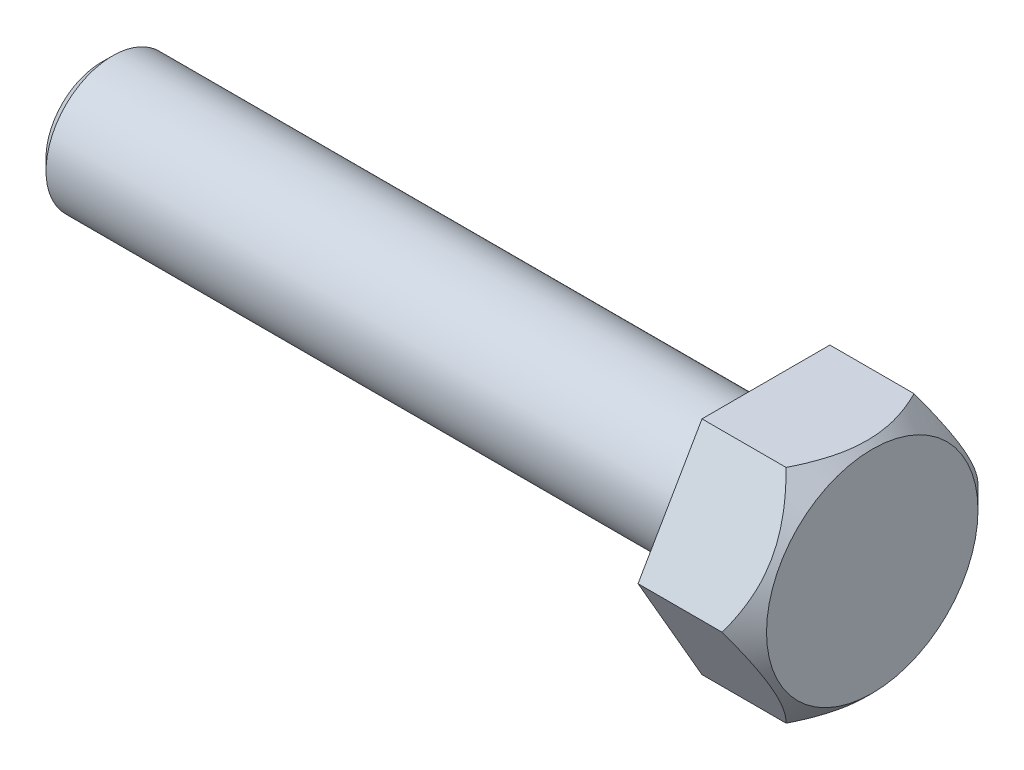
ISO-10303-21;
HEADER;
FILE_DESCRIPTION(('STEP AP214'),'2;1');
FILE_NAME('part.step','',(''),(''),'','','');
FILE_SCHEMA(('AUTOMOTIVE_DESIGN { 1 0 10303 214 1 1 1 1 }'));
ENDSEC;
DATA;
#1=APPLICATION_CONTEXT('core data for automotive mechanical design processes');
#2=APPLICATION_PROTOCOL_DEFINITION('international standard','automotive_design',2000,#1);
#3=PRODUCT_CONTEXT('',#1,'mechanical');
#4=PRODUCT('Part','Part','',(#3));
#5=PRODUCT_RELATED_PRODUCT_CATEGORY('part','',(#4));
#6=PRODUCT_DEFINITION_FORMATION('','',#4);
#7=PRODUCT_DEFINITION_CONTEXT('part definition',#1,'design');
#8=PRODUCT_DEFINITION('design','',#6,#7);
#9=PRODUCT_DEFINITION_SHAPE('','',#8);
#10=(LENGTH_UNIT() NAMED_UNIT(*) SI_UNIT(.MILLI.,.METRE.));
#11=(NAMED_UNIT(*) PLANE_ANGLE_UNIT() SI_UNIT($,.RADIAN.));
#12=(NAMED_UNIT(*) SI_UNIT($,.STERADIAN.) SOLID_ANGLE_UNIT());
#13=UNCERTAINTY_MEASURE_WITH_UNIT(LENGTH_MEASURE(1.E-05),#10,'distance_accuracy_value','');
#14=(GEOMETRIC_REPRESENTATION_CONTEXT(3) GLOBAL_UNCERTAINTY_ASSIGNED_CONTEXT((#13)) GLOBAL_UNIT_ASSIGNED_CONTEXT((#10,
#11,#12)) REPRESENTATION_CONTEXT('',''));
#15=CARTESIAN_POINT('',(0.,0.,0.));
#16=DIRECTION('',(0.,0.,1.));
#17=DIRECTION('',(1.,0.,0.));
#18=AXIS2_PLACEMENT_3D('',#15,#16,#17);
#19=CARTESIAN_POINT('',(4.80000000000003,5.,2.88675134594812));
#20=DIRECTION('',(0.,-0.500000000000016,-0.866025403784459));
#21=DIRECTION('',(0.,0.866025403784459,-0.500000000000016));
#22=AXIS2_PLACEMENT_3D('',#19,#20,#21);
#23=PLANE('',#22);
#24=CARTESIAN_POINT('',(3.79988452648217,5.00020000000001,2.88663587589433));
#25=CARTESIAN_POINT('',(3.84951645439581,4.91422723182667,2.93627227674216));
#26=CARTESIAN_POINT('',(3.89762527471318,4.82759363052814,2.98629020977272));
#27=CARTESIAN_POINT('',(3.99033336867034,4.65287511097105,3.08716399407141));
#28=CARTESIAN_POINT('',(4.03493072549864,4.56478943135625,3.13802028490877));
#29=CARTESIAN_POINT('',(4.1631409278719,4.29734143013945,3.29243146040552));
#30=CARTESIAN_POINT('',(4.24062493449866,4.1157150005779,3.39729352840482));
#31=CARTESIAN_POINT('',(4.37331105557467,3.7494507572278,3.60875628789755));
#32=CARTESIAN_POINT('',(4.42884745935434,3.56490656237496,3.71530292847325));
#33=CARTESIAN_POINT('',(4.49308950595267,3.28505622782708,3.87687459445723));
#34=CARTESIAN_POINT('',(4.51131783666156,3.19136076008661,3.93096969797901));
#35=CARTESIAN_POINT('',(4.54100781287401,3.00317647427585,4.03961794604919));
#36=CARTESIAN_POINT('',(4.55247046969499,2.90868777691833,4.09417102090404));
#37=CARTESIAN_POINT('',(4.57168913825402,2.67843374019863,4.22710825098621));
#38=CARTESIAN_POINT('',(4.57572171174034,2.54242031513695,4.30563563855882));
#39=CARTESIAN_POINT('',(4.56895414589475,2.27063858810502,4.46254889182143));
#40=CARTESIAN_POINT('',(4.55814880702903,2.13487038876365,4.54093469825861));
#41=CARTESIAN_POINT('',(4.52234235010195,1.86461396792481,4.69696731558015));
#42=CARTESIAN_POINT('',(4.49732535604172,1.73012734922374,4.77461320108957));
#43=CARTESIAN_POINT('',(4.43445567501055,1.46346560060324,4.92857043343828));
#44=CARTESIAN_POINT('',(4.39660397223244,1.33129029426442,5.00488188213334));
#45=CARTESIAN_POINT('',(4.31873011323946,1.09665179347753,5.14035048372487));
#46=CARTESIAN_POINT('',(4.28075574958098,0.993669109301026,5.19980756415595));
#47=CARTESIAN_POINT('',(4.19868737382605,0.789552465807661,5.31765436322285));
#48=CARTESIAN_POINT('',(4.15459317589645,0.688418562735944,5.37604404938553));
#49=CARTESIAN_POINT('',(4.06127361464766,0.488318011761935,5.49157215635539));
#50=CARTESIAN_POINT('',(4.01206438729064,0.389345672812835,5.54871386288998));
#51=CARTESIAN_POINT('',(3.90916087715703,0.193233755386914,5.66193913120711));
#52=CARTESIAN_POINT('',(3.85546934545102,0.0960930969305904,5.71802331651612));
#53=CARTESIAN_POINT('',(3.79988452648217,-0.000200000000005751,5.7736181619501));
#54=B_SPLINE_CURVE_WITH_KNOTS('',3,(#24,#25,#26,#27,#28,#29,#30,#31,#32,#33,#34,#35,#36,#37,#38,
#39,#40,#41,#42,#43,#44,#45,#46,#47,#48,#49,#50,#51,#52,#53),.UNSPECIFIED.,.F.,.F.,(4,2,2,2,2,2,
2,2,2,2,2,2,2,2,4),(0.,0.332945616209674,0.666071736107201,1.33592065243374,1.99513262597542,
2.32409207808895,2.65300234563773,3.12358963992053,3.5943418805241,4.06562104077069,
4.53686407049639,4.91117956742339,5.28550643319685,5.65868635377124,6.03163889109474),.UNSPECIFIED.);
#55=CARTESIAN_POINT('',(3.80000000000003,5.,2.88675134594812));
#56=VERTEX_POINT('',#55);
#57=CARTESIAN_POINT('',(3.80000000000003,-2.22044604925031E-13,5.77350269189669));
#58=VERTEX_POINT('',#57);
#59=EDGE_CURVE('E88',#56,#58,#54,.T.);
#60=ORIENTED_EDGE('',*,*,#59,.F.);
#61=DIRECTION('',(-1.,0.,0.));
#62=VECTOR('',#61,1.);
#63=CARTESIAN_POINT('',(4.80000000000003,5.,2.88675134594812));
#64=LINE('',#63,#62);
#65=CARTESIAN_POINT('',(0.,5.,2.88675134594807));
#66=VERTEX_POINT('',#65);
#67=EDGE_CURVE('E59',#56,#66,#64,.T.);
#68=ORIENTED_EDGE('',*,*,#67,.T.);
#69=DIRECTION('',(0.,-0.866025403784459,0.500000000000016));
#70=VECTOR('',#69,1.);
#71=CARTESIAN_POINT('',(0.,5.,2.88675134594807));
#72=LINE('',#71,#70);
#73=CARTESIAN_POINT('',(0.,-3.33066907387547E-13,5.77350269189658));
#74=VERTEX_POINT('',#73);
#75=EDGE_CURVE('E95',#66,#74,#72,.T.);
#76=ORIENTED_EDGE('',*,*,#75,.T.);
#77=DIRECTION('',(-1.,0.,0.));
#78=VECTOR('',#77,1.);
#79=CARTESIAN_POINT('',(4.80000000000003,-2.22044604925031E-13,5.77350269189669));
#80=LINE('',#79,#78);
#81=EDGE_CURVE('E101',#58,#74,#80,.T.);
#82=ORIENTED_EDGE('',*,*,#81,.F.);
#83=EDGE_LOOP('',(#60,#68,#76,#82));
#84=FACE_BOUND('',#83,.T.);
#85=ADVANCED_FACE('F36',(#84),#23,.F.);
#86=CARTESIAN_POINT('',(4.80000000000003,-2.22044604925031E-13,5.77350269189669));
#87=DIRECTION('',(0.,0.500000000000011,-0.866025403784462));
#88=DIRECTION('',(0.,0.866025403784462,0.50000000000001));
#89=AXIS2_PLACEMENT_3D('',#86,#87,#88);
#90=PLANE('',#89);
#91=CARTESIAN_POINT('',(3.79988452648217,0.000199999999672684,5.77361816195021));
#92=CARTESIAN_POINT('',(3.84951645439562,-0.0857727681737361,5.72398176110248));
#93=CARTESIAN_POINT('',(3.8976252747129,-0.172406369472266,5.67396382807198));
#94=CARTESIAN_POINT('',(3.99033336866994,-0.347124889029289,5.57309004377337));
#95=CARTESIAN_POINT('',(4.03493072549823,-0.435210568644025,5.52223375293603));
#96=CARTESIAN_POINT('',(4.16314092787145,-0.702658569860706,5.36782257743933));
#97=CARTESIAN_POINT('',(4.24062493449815,-0.884284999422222,5.26296050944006));
#98=CARTESIAN_POINT('',(4.37331105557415,-1.25054924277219,5.05149774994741));
#99=CARTESIAN_POINT('',(4.42884745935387,-1.43509343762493,4.94495110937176));
#100=CARTESIAN_POINT('',(4.49308950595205,-1.71494377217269,4.78337944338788));
#101=CARTESIAN_POINT('',(4.51131783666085,-1.80863923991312,4.72928433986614));
#102=CARTESIAN_POINT('',(4.54100781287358,-1.99682352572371,4.62063609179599));
#103=CARTESIAN_POINT('',(4.55247046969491,-2.09131222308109,4.56608301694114));
#104=CARTESIAN_POINT('',(4.57168913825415,-2.32156625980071,4.43314578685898));
#105=CARTESIAN_POINT('',(4.57572171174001,-2.45757968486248,4.35461839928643));
#106=CARTESIAN_POINT('',(4.56895414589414,-2.72936141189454,4.19770514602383));
#107=CARTESIAN_POINT('',(4.55814880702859,-2.86512961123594,4.1193193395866));
#108=CARTESIAN_POINT('',(4.52234235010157,-3.13538603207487,3.96328672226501));
#109=CARTESIAN_POINT('',(4.49732535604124,-3.26987265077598,3.88564083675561));
#110=CARTESIAN_POINT('',(4.43445567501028,-3.53653439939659,3.73168360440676));
#111=CARTESIAN_POINT('',(4.39660397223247,-3.66870970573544,3.65537215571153));
#112=CARTESIAN_POINT('',(4.31873011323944,-3.90334820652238,3.51990355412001));
#113=CARTESIAN_POINT('',(4.28075574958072,-4.00633089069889,3.46044647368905));
#114=CARTESIAN_POINT('',(4.19868737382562,-4.21044753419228,3.3425996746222));
#115=CARTESIAN_POINT('',(4.15459317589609,-4.31158143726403,3.28420998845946));
#116=CARTESIAN_POINT('',(4.06127361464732,-4.5116819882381,3.16868188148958));
#117=CARTESIAN_POINT('',(4.01206438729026,-4.61065432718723,3.11154017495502));
#118=CARTESIAN_POINT('',(3.90916087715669,-4.80676624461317,2.99831490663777));
#119=CARTESIAN_POINT('',(3.85546934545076,-4.90390690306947,2.94223072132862));
#120=CARTESIAN_POINT('',(3.79988452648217,-5.00020000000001,2.88663587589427));
#121=B_SPLINE_CURVE_WITH_KNOTS('',3,(#91,#92,#93,#94,#95,#96,#97,#98,#99,#100,#101,#102,#103,
#104,#105,#106,#107,#108,#109,#110,#111,#112,#113,#114,#115,#116,#117,#118,#119,#120),
.UNSPECIFIED.,.F.,.F.,(4,2,2,2,2,2,2,2,2,2,2,2,2,2,4),(0.,0.332945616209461,0.666071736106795,
1.33592065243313,1.99513262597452,2.32409207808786,2.65300234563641,3.1235896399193,
3.59434188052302,4.06562104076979,4.5368640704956,4.91117956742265,5.2855064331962,
5.65868635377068,6.03163889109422),.UNSPECIFIED.);
#122=CARTESIAN_POINT('',(3.80000000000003,-5.00000000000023,2.88675134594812));
#123=VERTEX_POINT('',#122);
#124=EDGE_CURVE('E91',#58,#123,#121,.T.);
#125=ORIENTED_EDGE('',*,*,#124,.F.);
#126=ORIENTED_EDGE('',*,*,#81,.T.);
#127=DIRECTION('',(0.,-0.866025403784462,-0.500000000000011));
#128=VECTOR('',#127,1.);
#129=CARTESIAN_POINT('',(0.,-3.33066907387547E-13,5.77350269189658));
#130=LINE('',#129,#128);
#131=CARTESIAN_POINT('',(0.,-5.00000000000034,2.88675134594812));
#132=VERTEX_POINT('',#131);
#133=EDGE_CURVE('E222',#74,#132,#130,.T.);
#134=ORIENTED_EDGE('',*,*,#133,.T.);
#135=DIRECTION('',(-1.,0.,0.));
#136=VECTOR('',#135,1.);
#137=CARTESIAN_POINT('',(4.80000000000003,-5.00000000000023,2.88675134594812));
#138=LINE('',#137,#136);
#139=EDGE_CURVE('E102',#123,#132,#138,.T.);
#140=ORIENTED_EDGE('',*,*,#139,.F.);
#141=EDGE_LOOP('',(#125,#126,#134,#140));
#142=FACE_BOUND('',#141,.T.);
#143=ADVANCED_FACE('F99',(#142),#90,.F.);
#144=CARTESIAN_POINT('',(4.80000000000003,-5.00000000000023,2.88675134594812));
#145=DIRECTION('',(0.,1.00000000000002,0.));
#146=DIRECTION('',(0.,0.,1.00000000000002));
#147=AXIS2_PLACEMENT_3D('',#144,#145,#146);
#148=PLANE('',#147);
#149=CARTESIAN_POINT('',(1.81432336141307,-5.,-5.9333686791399));
#150=CARTESIAN_POINT('',(1.92418858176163,-5.00000000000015,-5.78966341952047));
#151=CARTESIAN_POINT('',(2.03304389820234,-5.00000000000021,-5.64517359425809));
#152=CARTESIAN_POINT('',(2.24827641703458,-5.00000000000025,-5.35430787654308));
#153=CARTESIAN_POINT('',(2.35465301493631,-5.00000000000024,-5.20793153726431));
#154=CARTESIAN_POINT('',(2.56522692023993,-5.00000000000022,-4.91190536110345));
#155=CARTESIAN_POINT('',(2.6694010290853,-5.00000000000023,-4.76223896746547));
#156=CARTESIAN_POINT('',(2.87403749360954,-5.00000000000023,-4.46039793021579));
#157=CARTESIAN_POINT('',(2.97450010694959,-5.00000000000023,-4.30822346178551));
#158=CARTESIAN_POINT('',(3.17689028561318,-5.00000000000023,-3.99153933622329));
#159=CARTESIAN_POINT('',(3.27853053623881,-5.00000000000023,-3.82684512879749));
#160=CARTESIAN_POINT('',(3.47537782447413,-5.00000000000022,-3.49359569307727));
#161=CARTESIAN_POINT('',(3.57058380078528,-5.00000000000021,-3.32503983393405));
#162=CARTESIAN_POINT('',(3.75252582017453,-5.00000000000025,-2.98404180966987));
#163=CARTESIAN_POINT('',(3.83928674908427,-5.00000000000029,-2.81161302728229));
#164=CARTESIAN_POINT('',(4.00239520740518,-5.00000000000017,-2.46193775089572));
#165=CARTESIAN_POINT('',(4.07874758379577,-4.99999999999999,-2.28469354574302));
#166=CARTESIAN_POINT('',(4.21181755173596,-5.00000000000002,-1.94171568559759));
#167=CARTESIAN_POINT('',(4.26969922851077,-5.00000000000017,-1.77643834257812));
#168=CARTESIAN_POINT('',(4.37222452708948,-5.00000000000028,-1.44175059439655));
#169=CARTESIAN_POINT('',(4.41686728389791,-5.00000000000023,-1.27233991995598));
#170=CARTESIAN_POINT('',(4.48978435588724,-5.00000000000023,-0.933301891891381));
#171=CARTESIAN_POINT('',(4.51835018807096,-5.00000000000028,-0.763738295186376));
#172=CARTESIAN_POINT('',(4.55853073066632,-5.00000000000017,-0.422603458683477));
#173=CARTESIAN_POINT('',(4.57014874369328,-5.,-0.251032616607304));
#174=CARTESIAN_POINT('',(4.5754864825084,-5.00000000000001,0.0853406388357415));
#175=CARTESIAN_POINT('',(4.56992113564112,-5.00000000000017,0.250131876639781));
#176=CARTESIAN_POINT('',(4.54282076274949,-5.00000000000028,0.578387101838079));
#177=CARTESIAN_POINT('',(4.52128424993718,-5.00000000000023,0.741850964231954));
#178=CARTESIAN_POINT('',(4.46307865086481,-5.00000000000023,1.06903592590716));
#179=CARTESIAN_POINT('',(4.42614570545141,-5.00000000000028,1.23270929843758));
#180=CARTESIAN_POINT('',(4.33916921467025,-5.00000000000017,1.55646565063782));
#181=CARTESIAN_POINT('',(4.28912653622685,-5.00000000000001,1.71654886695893));
#182=CARTESIAN_POINT('',(4.17425220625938,-5.,2.04376834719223));
#183=CARTESIAN_POINT('',(4.1086370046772,-5.00000000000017,2.21062650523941));
#184=CARTESIAN_POINT('',(3.96728810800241,-5.00000000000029,2.54003854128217));
#185=CARTESIAN_POINT('',(3.89154980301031,-5.00000000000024,2.70259041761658));
#186=CARTESIAN_POINT('',(3.7317524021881,-5.00000000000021,3.02416565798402));
#187=CARTESIAN_POINT('',(3.64766751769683,-5.00000000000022,3.18317610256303));
#188=CARTESIAN_POINT('',(3.47302987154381,-5.00000000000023,3.49754870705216));
#189=CARTESIAN_POINT('',(3.38247811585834,-5.00000000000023,3.65291142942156));
#190=CARTESIAN_POINT('',(3.20078159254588,-5.00000000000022,3.95285892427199));
#191=CARTESIAN_POINT('',(3.10988790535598,-5.00000000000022,4.09759659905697));
#192=CARTESIAN_POINT('',(2.92424528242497,-5.00000000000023,4.38458573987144));
#193=CARTESIAN_POINT('',(2.82949605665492,-5.00000000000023,4.52683701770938));
#194=CARTESIAN_POINT('',(2.63760520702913,-5.00000000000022,4.80803186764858));
#195=CARTESIAN_POINT('',(2.54048901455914,-5.00000000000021,4.94699285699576));
#196=CARTESIAN_POINT('',(2.34366358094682,-5.00000000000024,5.22301057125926));
#197=CARTESIAN_POINT('',(2.24395506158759,-5.00000000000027,5.36006781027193));
#198=CARTESIAN_POINT('',(2.1431858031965,-5.00000000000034,5.49632687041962));
#199=B_SPLINE_CURVE_WITH_KNOTS('',3,(#149,#150,#151,#152,#153,#154,#155,#156,#157,#158,#159,
#160,#161,#162,#163,#164,#165,#166,#167,#168,#169,#170,#171,#172,#173,#174,#175,#176,#177,#178,
#179,#180,#181,#182,#183,#184,#185,#186,#187,#188,#189,#190,#191,#192,#193,#194,#195,#196,#197,
#198),.UNSPECIFIED.,.F.,.F.,(4,2,2,2,2,2,2,2,2,2,2,2,2,2,2,2,2,2,2,2,2,2,2,2,4),(0.,
0.542683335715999,1.08549766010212,1.63250741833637,2.17947913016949,2.7599604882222,
3.34053736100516,3.91934802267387,4.49788822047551,5.02279153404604,5.54772913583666,
6.06281331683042,6.57779711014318,7.07164749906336,7.56554386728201,8.06827708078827,
8.57097705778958,9.10845041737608,9.64616937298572,10.1856047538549,10.7249564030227,
11.2376185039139,11.7503192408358,12.2588884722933,12.7673175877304),.UNSPECIFIED.);
#200=CARTESIAN_POINT('',(3.80000000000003,-5.00000000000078,-2.8867513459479));
#201=VERTEX_POINT('',#200);
#202=EDGE_CURVE('E103',#123,#201,#199,.F.);
#203=ORIENTED_EDGE('',*,*,#202,.F.);
#204=ORIENTED_EDGE('',*,*,#139,.T.);
#205=DIRECTION('',(0.,0.,-1.00000000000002));
#206=VECTOR('',#205,1.);
#207=CARTESIAN_POINT('',(0.,-5.00000000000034,2.88675134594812));
#208=LINE('',#207,#206);
#209=CARTESIAN_POINT('',(0.,-5.00000000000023,-2.88675134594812));
#210=VERTEX_POINT('',#209);
#211=EDGE_CURVE('E221',#132,#210,#208,.T.);
#212=ORIENTED_EDGE('',*,*,#211,.T.);
#213=DIRECTION('',(-1.,0.,0.));
#214=VECTOR('',#213,1.);
#215=CARTESIAN_POINT('',(4.80000000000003,-5.00000000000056,-2.88675134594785));
#216=LINE('',#215,#214);
#217=EDGE_CURVE('E110',#201,#210,#216,.T.);
#218=ORIENTED_EDGE('',*,*,#217,.F.);
#219=EDGE_LOOP('',(#203,#204,#212,#218));
#220=FACE_BOUND('',#219,.T.);
#221=ADVANCED_FACE('F139',(#220),#148,.F.);
#222=CARTESIAN_POINT('',(4.80000000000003,0.,-5.77350269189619));
#223=DIRECTION('',(0.,-0.500000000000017,-0.866025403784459));
#224=DIRECTION('',(0.,0.866025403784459,-0.500000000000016));
#225=AXIS2_PLACEMENT_3D('',#222,#223,#224);
#226=PLANE('',#225);
#227=DIRECTION('',(-1.,0.,0.));
#228=VECTOR('',#227,1.);
#229=CARTESIAN_POINT('',(4.80000000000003,0.,-5.77350269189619));
#230=LINE('',#229,#228);
#231=CARTESIAN_POINT('',(3.80000000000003,0.,-5.77350269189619));
#232=VERTEX_POINT('',#231);
#233=CARTESIAN_POINT('',(0.,1.11022302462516E-13,-5.77350269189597));
#234=VERTEX_POINT('',#233);
#235=EDGE_CURVE('E205',#232,#234,#230,.T.);
#236=ORIENTED_EDGE('',*,*,#235,.F.);
#237=CARTESIAN_POINT('',(3.79988452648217,0.000199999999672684,-5.77361816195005));
#238=CARTESIAN_POINT('',(3.84951645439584,-0.0857727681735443,-5.72398176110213));
#239=CARTESIAN_POINT('',(3.89762527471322,-0.172406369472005,-5.67396382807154));
#240=CARTESIAN_POINT('',(3.99033336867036,-0.347124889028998,-5.57309004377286));
#241=CARTESIAN_POINT('',(4.03493072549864,-0.435210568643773,-5.52223375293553));
#242=CARTESIAN_POINT('',(4.16314092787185,-0.702658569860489,-5.36782257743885));
#243=CARTESIAN_POINT('',(4.24062493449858,-0.884284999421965,-5.26296050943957));
#244=CARTESIAN_POINT('',(4.37331105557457,-1.25054924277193,-5.05149774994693));
#245=CARTESIAN_POINT('',(4.42884745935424,-1.43509343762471,-4.94495110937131));
#246=CARTESIAN_POINT('',(4.49308950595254,-1.71494377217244,-4.78337944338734));
#247=CARTESIAN_POINT('',(4.51131783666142,-1.80863923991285,-4.72928433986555));
#248=CARTESIAN_POINT('',(4.54100781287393,-1.9968235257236,-4.62063609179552));
#249=CARTESIAN_POINT('',(4.55247046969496,-2.09131222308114,-4.56608301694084));
#250=CARTESIAN_POINT('',(4.57168913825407,-2.32156625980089,-4.43314578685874));
#251=CARTESIAN_POINT('',(4.57572171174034,-2.4575796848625,-4.3546183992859));
#252=CARTESIAN_POINT('',(4.56895414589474,-2.72936141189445,-4.1977051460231));
#253=CARTESIAN_POINT('',(4.55814880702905,-2.8651296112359,-4.11931933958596));
#254=CARTESIAN_POINT('',(4.52234235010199,-3.13538603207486,-3.96328672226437));
#255=CARTESIAN_POINT('',(4.49732535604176,-3.26987265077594,-3.88564083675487));
#256=CARTESIAN_POINT('',(4.43445567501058,-3.5365343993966,-3.7316836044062));
#257=CARTESIAN_POINT('',(4.39660397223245,-3.66870970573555,-3.65537215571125));
#258=CARTESIAN_POINT('',(4.31873011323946,-3.90334820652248,-3.51990355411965));
#259=CARTESIAN_POINT('',(4.28075574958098,-4.00633089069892,-3.46044647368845));
#260=CARTESIAN_POINT('',(4.19868737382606,-4.21044753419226,-3.34259967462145));
#261=CARTESIAN_POINT('',(4.15459317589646,-4.311581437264,-3.2842099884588));
#262=CARTESIAN_POINT('',(4.06127361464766,-4.51168198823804,-3.16868188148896));
#263=CARTESIAN_POINT('',(4.01206438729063,-4.61065432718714,-3.11154017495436));
#264=CARTESIAN_POINT('',(3.90916087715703,-4.80676624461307,-2.9983149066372));
#265=CARTESIAN_POINT('',(3.85546934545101,-4.9039069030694,-2.94223072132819));
#266=CARTESIAN_POINT('',(3.79988452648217,-5.00020000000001,-2.88663587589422));
#267=B_SPLINE_CURVE_WITH_KNOTS('',3,(#237,#238,#239,#240,#241,#242,#243,#244,#245,#246,#247,
#248,#249,#250,#251,#252,#253,#254,#255,#256,#257,#258,#259,#260,#261,#262,#263,#264,#265,#266),
.UNSPECIFIED.,.F.,.F.,(4,2,2,2,2,2,2,2,2,2,2,2,2,2,4),(0.,0.332945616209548,0.666071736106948,
1.33592065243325,1.99513262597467,2.32409207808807,2.65300234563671,3.12358963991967,
3.5943418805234,4.06562104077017,4.53686407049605,4.91117956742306,5.28550643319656,
5.65868635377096,6.0316388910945),.UNSPECIFIED.);
#268=EDGE_CURVE('E172',#232,#201,#267,.T.);
#269=ORIENTED_EDGE('',*,*,#268,.T.);
#270=ORIENTED_EDGE('',*,*,#217,.T.);
#271=DIRECTION('',(0.,-0.866025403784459,0.500000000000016));
#272=VECTOR('',#271,1.);
#273=CARTESIAN_POINT('',(0.,1.11022302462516E-13,-5.77350269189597));
#274=LINE('',#273,#272);
#275=EDGE_CURVE('E218',#234,#210,#274,.T.);
#276=ORIENTED_EDGE('',*,*,#275,.F.);
#277=EDGE_LOOP('',(#236,#269,#270,#276));
#278=FACE_BOUND('',#277,.T.);
#279=ADVANCED_FACE('F183',(#278),#226,.T.);
#280=CARTESIAN_POINT('',(4.80000000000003,4.99999999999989,-2.88675134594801));
#281=DIRECTION('',(0.,0.500000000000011,-0.866025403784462));
#282=DIRECTION('',(0.,0.866025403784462,0.50000000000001));
#283=AXIS2_PLACEMENT_3D('',#280,#281,#282);
#284=PLANE('',#283);
#285=DIRECTION('',(-1.,0.,0.));
#286=VECTOR('',#285,1.);
#287=CARTESIAN_POINT('',(4.80000000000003,4.99999999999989,-2.88675134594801));
#288=LINE('',#287,#286);
#289=CARTESIAN_POINT('',(3.80000000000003,4.99999999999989,-2.88675134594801));
#290=VERTEX_POINT('',#289);
#291=CARTESIAN_POINT('',(0.,4.99999999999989,-2.88675134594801));
#292=VERTEX_POINT('',#291);
#293=EDGE_CURVE('E203',#290,#292,#288,.T.);
#294=ORIENTED_EDGE('',*,*,#293,.F.);
#295=CARTESIAN_POINT('',(3.79988452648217,5.00019999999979,-2.88663587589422));
#296=CARTESIAN_POINT('',(3.84951645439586,4.91422723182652,-2.93627227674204));
#297=CARTESIAN_POINT('',(3.89762527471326,4.82759363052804,-2.98629020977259));
#298=CARTESIAN_POINT('',(3.99033336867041,4.65287511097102,-3.08716399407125));
#299=CARTESIAN_POINT('',(4.03493072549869,4.56478943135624,-3.13802028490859));
#300=CARTESIAN_POINT('',(4.1631409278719,4.29734143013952,-3.29243146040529));
#301=CARTESIAN_POINT('',(4.24062493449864,4.11571500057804,-3.39729352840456));
#302=CARTESIAN_POINT('',(4.37331105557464,3.74945075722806,-3.60875628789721));
#303=CARTESIAN_POINT('',(4.4288474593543,3.56490656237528,-3.71530292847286));
#304=CARTESIAN_POINT('',(4.49308950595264,3.2850562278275,-3.8768745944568));
#305=CARTESIAN_POINT('',(4.51131783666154,3.19136076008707,-3.93096969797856));
#306=CARTESIAN_POINT('',(4.541007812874,3.00317647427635,-4.0396179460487));
#307=CARTESIAN_POINT('',(4.55247046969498,2.90868777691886,-4.0941710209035));
#308=CARTESIAN_POINT('',(4.57168913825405,2.67843374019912,-4.22710825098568));
#309=CARTESIAN_POINT('',(4.5757217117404,2.54242031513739,-4.30563563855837));
#310=CARTESIAN_POINT('',(4.56895414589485,2.27063858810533,-4.46254889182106));
#311=CARTESIAN_POINT('',(4.55814880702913,2.13487038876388,-4.54093469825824));
#312=CARTESIAN_POINT('',(4.52234235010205,1.86461396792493,-4.69696731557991));
#313=CARTESIAN_POINT('',(4.49732535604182,1.73012734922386,-4.77461320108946));
#314=CARTESIAN_POINT('',(4.43445567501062,1.46346560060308,-4.928570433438));
#315=CARTESIAN_POINT('',(4.39660397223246,1.33129029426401,-5.00488188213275));
#316=CARTESIAN_POINT('',(4.31873011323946,1.09665179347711,-5.1403504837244));
#317=CARTESIAN_POINT('',(4.28075574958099,0.993669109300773,-5.19980756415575));
#318=CARTESIAN_POINT('',(4.19868737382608,0.789552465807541,-5.31765436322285));
#319=CARTESIAN_POINT('',(4.15459317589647,0.688418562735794,-5.37604404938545));
#320=CARTESIAN_POINT('',(4.06127361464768,0.488318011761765,-5.49157215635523));
#321=CARTESIAN_POINT('',(4.01206438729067,0.389345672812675,-5.54871386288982));
#322=CARTESIAN_POINT('',(3.90916087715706,0.193233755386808,-5.661939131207));
#323=CARTESIAN_POINT('',(3.85546934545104,0.0960930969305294,-5.71802331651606));
#324=CARTESIAN_POINT('',(3.79988452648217,-0.000200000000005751,-5.7736181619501));
#325=B_SPLINE_CURVE_WITH_KNOTS('',3,(#295,#296,#297,#298,#299,#300,#301,#302,#303,#304,#305,
#306,#307,#308,#309,#310,#311,#312,#313,#314,#315,#316,#317,#318,#319,#320,#321,#322,#323,#324),
.UNSPECIFIED.,.F.,.F.,(4,2,2,2,2,2,2,2,2,2,2,2,2,2,4),(0.,0.332945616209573,0.666071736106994,
1.3359206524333,1.99513262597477,2.3240920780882,2.65300234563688,3.1235896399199,
3.5943418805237,4.06562104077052,4.53686407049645,4.91117956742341,5.28550643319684,
5.6586863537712,6.03163889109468),.UNSPECIFIED.);
#326=EDGE_CURVE('E51',#290,#232,#325,.T.);
#327=ORIENTED_EDGE('',*,*,#326,.T.);
#328=ORIENTED_EDGE('',*,*,#235,.T.);
#329=DIRECTION('',(0.,-0.866025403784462,-0.500000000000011));
#330=VECTOR('',#329,1.);
#331=CARTESIAN_POINT('',(0.,4.99999999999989,-2.88675134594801));
#332=LINE('',#331,#330);
#333=EDGE_CURVE('E207',#292,#234,#332,.T.);
#334=ORIENTED_EDGE('',*,*,#333,.F.);
#335=EDGE_LOOP('',(#294,#327,#328,#334));
#336=FACE_BOUND('',#335,.T.);
#337=ADVANCED_FACE('F193',(#336),#284,.T.);
#338=CARTESIAN_POINT('',(4.80000000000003,5.,2.88675134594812));
#339=DIRECTION('',(0.,1.00000000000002,0.));
#340=DIRECTION('',(0.,0.,1.00000000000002));
#341=AXIS2_PLACEMENT_3D('',#338,#339,#340);
#342=PLANE('',#341);
#343=ORIENTED_EDGE('',*,*,#67,.F.);
#344=CARTESIAN_POINT('',(1.81432336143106,4.99999999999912,-5.93336867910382));
#345=CARTESIAN_POINT('',(1.92418858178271,4.99999999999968,-5.7896634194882));
#346=CARTESIAN_POINT('',(2.03304389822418,4.99999999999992,-5.64517359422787));
#347=CARTESIAN_POINT('',(2.24827641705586,5.00000000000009,-5.35430787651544));
#348=CARTESIAN_POINT('',(2.35465301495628,5.00000000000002,-5.20793153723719));
#349=CARTESIAN_POINT('',(2.56522692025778,4.99999999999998,-4.91190536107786));
#350=CARTESIAN_POINT('',(2.66940102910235,5.,-4.76223896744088));
#351=CARTESIAN_POINT('',(2.87403749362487,5.00000000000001,-4.46039793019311));
#352=CARTESIAN_POINT('',(2.97450010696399,5.,-4.30822346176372));
#353=CARTESIAN_POINT('',(3.17689028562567,5.,-3.99153933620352));
#354=CARTESIAN_POINT('',(3.27853053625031,5.,-3.82684512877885));
#355=CARTESIAN_POINT('',(3.47537782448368,5.,-3.49359569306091));
#356=CARTESIAN_POINT('',(3.57058380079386,5.,-3.32503983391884));
#357=CARTESIAN_POINT('',(3.75252582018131,5.,-2.98404180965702));
#358=CARTESIAN_POINT('',(3.83928674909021,5.,-2.81161302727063));
#359=CARTESIAN_POINT('',(4.00239520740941,5.,-2.46193775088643));
#360=CARTESIAN_POINT('',(4.0787475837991,5.,-2.28469354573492));
#361=CARTESIAN_POINT('',(4.21181755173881,5.00000000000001,-1.94171568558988));
#362=CARTESIAN_POINT('',(4.26969922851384,5.00000000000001,-1.77643834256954));
#363=CARTESIAN_POINT('',(4.37222452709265,5.,-1.44175059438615));
#364=CARTESIAN_POINT('',(4.41686728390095,4.99999999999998,-1.27233991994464));
#365=CARTESIAN_POINT('',(4.48978435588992,5.00000000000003,-0.933301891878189));
#366=CARTESIAN_POINT('',(4.51835018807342,5.00000000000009,-0.763738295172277));
#367=CARTESIAN_POINT('',(4.55853073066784,4.99999999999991,-0.422603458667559));
#368=CARTESIAN_POINT('',(4.57014874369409,4.99999999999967,-0.251032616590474));
#369=CARTESIAN_POINT('',(4.57548648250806,4.99999999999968,0.0853406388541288));
#370=CARTESIAN_POINT('',(4.56992113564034,4.99999999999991,0.250131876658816));
#371=CARTESIAN_POINT('',(4.54282076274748,5.00000000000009,0.57838710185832));
#372=CARTESIAN_POINT('',(4.52128424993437,5.00000000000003,0.741850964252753));
#373=CARTESIAN_POINT('',(4.46307865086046,4.99999999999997,1.06903592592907));
#374=CARTESIAN_POINT('',(4.42614570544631,4.99999999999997,1.23270929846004));
#375=CARTESIAN_POINT('',(4.33916921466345,5.00000000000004,1.55646565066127));
#376=CARTESIAN_POINT('',(4.28912653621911,5.00000000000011,1.71654886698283));
#377=CARTESIAN_POINT('',(4.17425220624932,5.00000000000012,2.04376834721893));
#378=CARTESIAN_POINT('',(4.10863700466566,5.00000000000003,2.21062650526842));
#379=CARTESIAN_POINT('',(3.96728810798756,4.99999999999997,2.54003854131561));
#380=CARTESIAN_POINT('',(3.89154980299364,5.,2.70259041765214));
#381=CARTESIAN_POINT('',(3.73175240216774,5.00000000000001,3.02416565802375));
#382=CARTESIAN_POINT('',(3.6476675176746,5.00000000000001,3.18317610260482));
#383=CARTESIAN_POINT('',(3.47302987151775,5.,3.49754870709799));
#384=CARTESIAN_POINT('',(3.38247811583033,5.,3.65291142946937));
#385=CARTESIAN_POINT('',(3.20078159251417,5.00000000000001,3.95285892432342));
#386=CARTESIAN_POINT('',(3.10988790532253,5.00000000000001,4.09759659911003));
#387=CARTESIAN_POINT('',(2.92424528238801,5.00000000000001,4.38458573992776));
#388=CARTESIAN_POINT('',(2.82949605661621,5.00000000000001,4.5268370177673));
#389=CARTESIAN_POINT('',(2.63760520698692,5.00000000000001,4.80803186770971));
#390=CARTESIAN_POINT('',(2.54048901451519,5.00000000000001,4.94699285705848));
#391=CARTESIAN_POINT('',(2.34366358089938,5.00000000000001,5.22301057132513));
#392=CARTESIAN_POINT('',(2.24395506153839,5.00000000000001,5.36006781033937));
#393=CARTESIAN_POINT('',(2.14318580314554,5.,5.49632687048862));
#394=B_SPLINE_CURVE_WITH_KNOTS('',3,(#344,#345,#346,#347,#348,#349,#350,#351,#352,#353,#354,
#355,#356,#357,#358,#359,#360,#361,#362,#363,#364,#365,#366,#367,#368,#369,#370,#371,#372,#373,
#374,#375,#376,#377,#378,#379,#380,#381,#382,#383,#384,#385,#386,#387,#388,#389,#390,#391,#392,
#393),.UNSPECIFIED.,.F.,.F.,(4,2,2,2,2,2,2,2,2,2,2,2,2,2,2,2,2,2,2,2,2,2,2,2,4),(0.,
0.542683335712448,1.08549766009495,1.63250741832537,2.1794791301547,2.75996048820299,
3.3405373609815,3.91934802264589,4.49788822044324,5.02279153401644,5.54772913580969,
6.06281331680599,6.57779711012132,7.0716474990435,7.5655438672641,8.06827708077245,
8.5709770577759,9.10845041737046,9.64616937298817,10.1856047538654,10.7249564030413,
11.2376185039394,11.7503192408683,12.2588884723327,12.7673175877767),.UNSPECIFIED.);
#395=EDGE_CURVE('E93',#56,#290,#394,.F.);
#396=ORIENTED_EDGE('',*,*,#395,.T.);
#397=ORIENTED_EDGE('',*,*,#293,.T.);
#398=DIRECTION('',(0.,0.,-1.00000000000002));
#399=VECTOR('',#398,1.);
#400=CARTESIAN_POINT('',(0.,5.,2.88675134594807));
#401=LINE('',#400,#399);
#402=EDGE_CURVE('E202',#66,#292,#401,.T.);
#403=ORIENTED_EDGE('',*,*,#402,.F.);
#404=EDGE_LOOP('',(#343,#396,#397,#403));
#405=FACE_BOUND('',#404,.T.);
#406=ADVANCED_FACE('F144',(#405),#342,.T.);
#407=CARTESIAN_POINT('',(-30.,1.11022302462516E-13,-3.33066907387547E-13));
#408=DIRECTION('',(1.,0.,0.));
#409=DIRECTION('',(0.,0.,-1.00000000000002));
#410=AXIS2_PLACEMENT_3D('',#407,#408,#409);
#411=CYLINDRICAL_SURFACE('',#410,3.);
#412=CARTESIAN_POINT('',(-29.5,1.11022302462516E-13,-3.33066907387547E-13));
#413=DIRECTION('',(1.,0.,0.));
#414=DIRECTION('',(0.,0.,-1.00000000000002));
#415=AXIS2_PLACEMENT_3D('',#412,#413,#414);
#416=CIRCLE('',#415,3.);
#417=CARTESIAN_POINT('',(-29.5,1.10023101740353E-13,-3.0000000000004));
#418=VERTEX_POINT('',#417);
#419=EDGE_CURVE('E44',#418,#418,#416,.T.);
#420=ORIENTED_EDGE('',*,*,#419,.T.);
#421=EDGE_LOOP('',(#420));
#422=FACE_BOUND('',#421,.T.);
#423=CARTESIAN_POINT('',(0.,0.,0.));
#424=DIRECTION('',(1.,0.,0.));
#425=DIRECTION('',(0.,0.,-1.00000000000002));
#426=AXIS2_PLACEMENT_3D('',#423,#424,#425);
#427=CIRCLE('',#426,3.);
#428=CARTESIAN_POINT('',(0.,0.,-3.00000000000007));
#429=VERTEX_POINT('',#428);
#430=EDGE_CURVE('E106',#429,#429,#427,.T.);
#431=ORIENTED_EDGE('',*,*,#430,.F.);
#432=EDGE_LOOP('',(#431));
#433=FACE_BOUND('',#432,.T.);
#434=ADVANCED_FACE('F38',(#422,#433),#411,.T.);
#435=CARTESIAN_POINT('',(-30.,1.11022302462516E-13,-3.33066907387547E-13));
#436=DIRECTION('',(1.,0.,0.));
#437=DIRECTION('',(0.,0.,-1.00000000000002));
#438=AXIS2_PLACEMENT_3D('',#435,#436,#437);
#439=PLANE('',#438);
#440=CARTESIAN_POINT('',(-30.,1.11022302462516E-13,-3.33066907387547E-13));
#441=DIRECTION('',(1.,0.,0.));
#442=DIRECTION('',(0.,0.,-1.00000000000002));
#443=AXIS2_PLACEMENT_3D('',#440,#441,#442);
#444=CIRCLE('',#443,2.5);
#445=CARTESIAN_POINT('',(-30.,1.10189635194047E-13,-2.50000000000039));
#446=VERTEX_POINT('',#445);
#447=EDGE_CURVE('E11',#446,#446,#444,.F.);
#448=ORIENTED_EDGE('',*,*,#447,.T.);
#449=EDGE_LOOP('',(#448));
#450=FACE_BOUND('',#449,.T.);
#451=ADVANCED_FACE('F130',(#450),#439,.F.);
#452=CARTESIAN_POINT('',(0.,-3.33066907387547E-13,5.77350269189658));
#453=DIRECTION('',(1.,0.,0.));
#454=DIRECTION('',(0.,0.,-1.00000000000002));
#455=AXIS2_PLACEMENT_3D('',#452,#453,#454);
#456=PLANE('',#455);
#457=ORIENTED_EDGE('',*,*,#75,.F.);
#458=ORIENTED_EDGE('',*,*,#402,.T.);
#459=ORIENTED_EDGE('',*,*,#333,.T.);
#460=ORIENTED_EDGE('',*,*,#275,.T.);
#461=ORIENTED_EDGE('',*,*,#211,.F.);
#462=ORIENTED_EDGE('',*,*,#133,.F.);
#463=EDGE_LOOP('',(#457,#458,#459,#460,#461,#462));
#464=FACE_BOUND('',#463,.T.);
#465=ORIENTED_EDGE('',*,*,#430,.T.);
#466=EDGE_LOOP('',(#465));
#467=FACE_BOUND('',#466,.T.);
#468=ADVANCED_FACE('F120',(#464,#467),#456,.F.);
#469=CARTESIAN_POINT('',(-29.5,1.11022302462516E-13,-3.33066907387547E-13));
#470=DIRECTION('',(1.,0.,0.));
#471=DIRECTION('',(0.,0.,-1.00000000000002));
#472=AXIS2_PLACEMENT_3D('',#469,#470,#471);
#473=CONICAL_SURFACE('',#472,3.,0.785398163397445);
#474=ORIENTED_EDGE('',*,*,#447,.F.);
#475=EDGE_LOOP('',(#474));
#476=FACE_BOUND('',#475,.T.);
#477=ORIENTED_EDGE('',*,*,#419,.F.);
#478=EDGE_LOOP('',(#477));
#479=FACE_BOUND('',#478,.T.);
#480=ADVANCED_FACE('F118',(#476,#479),#473,.T.);
#481=CARTESIAN_POINT('',(3.80000000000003,0.,0.));
#482=DIRECTION('',(-1.,0.,0.));
#483=DIRECTION('',(0.,0.,1.00000000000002));
#484=AXIS2_PLACEMENT_3D('',#481,#482,#483);
#485=CONICAL_SURFACE('',#484,5.77350269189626,0.785398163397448);
#486=CARTESIAN_POINT('',(4.80000000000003,0.,0.));
#487=DIRECTION('',(-1.,0.,0.));
#488=DIRECTION('',(0.,0.,1.00000000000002));
#489=AXIS2_PLACEMENT_3D('',#486,#487,#488);
#490=CIRCLE('',#489,4.77350269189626);
#491=CARTESIAN_POINT('',(4.80000000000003,0.,4.77350269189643));
#492=VERTEX_POINT('',#491);
#493=EDGE_CURVE('E227',#492,#492,#490,.T.);
#494=ORIENTED_EDGE('',*,*,#493,.T.);
#495=EDGE_LOOP('',(#494));
#496=FACE_BOUND('',#495,.T.);
#497=ORIENTED_EDGE('',*,*,#59,.T.);
#498=ORIENTED_EDGE('',*,*,#124,.T.);
#499=ORIENTED_EDGE('',*,*,#202,.T.);
#500=ORIENTED_EDGE('',*,*,#268,.F.);
#501=ORIENTED_EDGE('',*,*,#326,.F.);
#502=ORIENTED_EDGE('',*,*,#395,.F.);
#503=EDGE_LOOP('',(#497,#498,#499,#500,#501,#502));
#504=FACE_BOUND('',#503,.T.);
#505=ADVANCED_FACE('F90',(#496,#504),#485,.T.);
#506=CARTESIAN_POINT('',(4.80000000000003,-2.22044604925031E-13,5.77350269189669));
#507=DIRECTION('',(1.,0.,0.));
#508=DIRECTION('',(0.,0.,-1.00000000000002));
#509=AXIS2_PLACEMENT_3D('',#506,#507,#508);
#510=PLANE('',#509);
#511=ORIENTED_EDGE('',*,*,#493,.F.);
#512=EDGE_LOOP('',(#511));
#513=FACE_BOUND('',#512,.T.);
#514=ADVANCED_FACE('F127',(#513),#510,.T.);
#515=CLOSED_SHELL('',(#85,#143,#221,#279,#337,#406,#434,#451,#468,#480,#505,#514));
#516=MANIFOLD_SOLID_BREP('B2',#515);
#517=ADVANCED_BREP_SHAPE_REPRESENTATION('',(#18,#516),#14);
#518=SHAPE_DEFINITION_REPRESENTATION(#9,#517);
ENDSEC;
END-ISO-10303-21;
